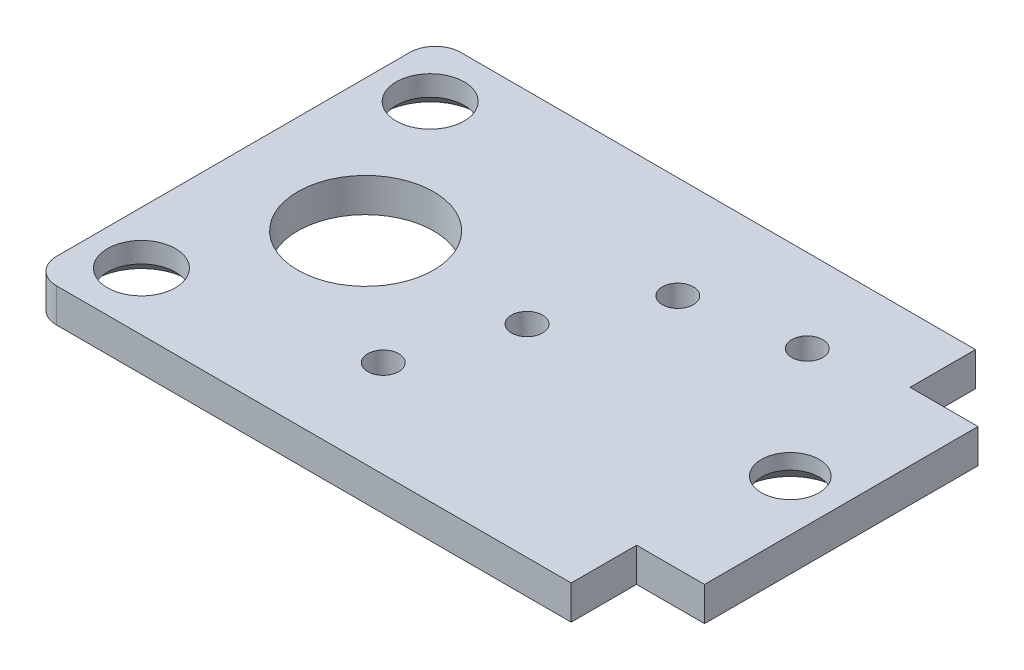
from build123d import *

# Parameters (mm, degrees)
SKETCH1_R           = 2
BOSS_EXTRUDE1_DEPTH = 1
SKETCH2_R           = 1
CUT_EXTRUDE1_DEPTH  = 16.244753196
FILLET1_R           = 0.75
CHAMFER1_SIZE       = 0.4
SKETCH3_R           = 0.4572
CUT_EXTRUDE2_DEPTH  = 16.244753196


with BuildPart() as part:
    # Sketch1 → Boss-Extrude1 (new body)
    with BuildSketch(Plane(origin=(0, 0, 0), x_dir=(1, 0, 0), z_dir=(0, 1, 0))):
        Polygon((12, 5.95), (-3.9, 5.95), (-3.9, -5.95), (12, -5.95), (12, -4.025), (14, -4.025), (14, 4.025), (12, 4.025), align=None)
        with Locations(Location((0, 0, 0), (0, 0, 270))):
            Circle(SKETCH1_R, mode=Mode.SUBTRACT)
    extrude(amount=BOSS_EXTRUDE1_DEPTH)

    # Sketch2 → Cut-Extrude1 (cut, through all)
    with BuildSketch(Plane(origin=(0, 1, 0), x_dir=(1, 0, 0), z_dir=(0, 1, 0))):
        with Locations(Location((-2.35, 4.25, 0), (0, 0, 270))):
            Circle(SKETCH2_R)
        with Locations(Location((-2.35, -4.25, 0), (0, 0, 270))):
            Circle(SKETCH2_R)
    extrude(amount=-CUT_EXTRUDE1_DEPTH, mode=Mode.SUBTRACT)

    # Fillet1
    fillet1_edges = [part.edges().sort_by_distance(p)[0] for p in [
        (-3.9, 0.5, -5.95),
        (-3.9, 0.5, 5.95),
    ]]
    fillet(fillet1_edges, radius=FILLET1_R)

    # Chamfer1
    chamfer1_edges = [part.edges().sort_by_distance(p)[0] for p in [
        (-2.35, 0, -5.25),
        (-2.35, 0, 3.25),
    ]]
    chamfer(chamfer1_edges, length=CHAMFER1_SIZE)

    # Sketch3 → Cut-Extrude2 (cut, through all)
    with BuildSketch(Plane(origin=(0, 1, 0), x_dir=(1, 0, 0), z_dir=(0, 1, 0))):
        with Locations(Location((3.61862915, -3.1, 0), (0, 0, 270))):
            Circle(SKETCH3_R)
        with Locations(Location((4.75, 0, 0), (0, 0, 270))):
            Circle(SKETCH3_R)
        with Locations(Location((6.247772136, 2.94052353, 0), (0, 0, 270))):
            Circle(SKETCH3_R)
        with Locations(Location((9.5, 3.5, 0), (0, 0, 270))):
            Circle(SKETCH3_R)
    extrude(amount=-CUT_EXTRUDE2_DEPTH, mode=Mode.SUBTRACT)

    # Sketch5 → CSK for M1.6 Countersunk Raised Head Scr (revolve, cut)
    with BuildSketch(Plane(origin=(12.5, 0, 0), x_dir=(0, 0, -1), z_dir=(1, 0, 0))):
        Polygon((0, 0), (0, 1), (0.85, 1), (0.85, 0.55), (1.4, 0), align=None)
    revolve(axis=Axis((12.5, -6.35, 0), (0, 1, 0)), mode=Mode.SUBTRACT)


solid = part.part
